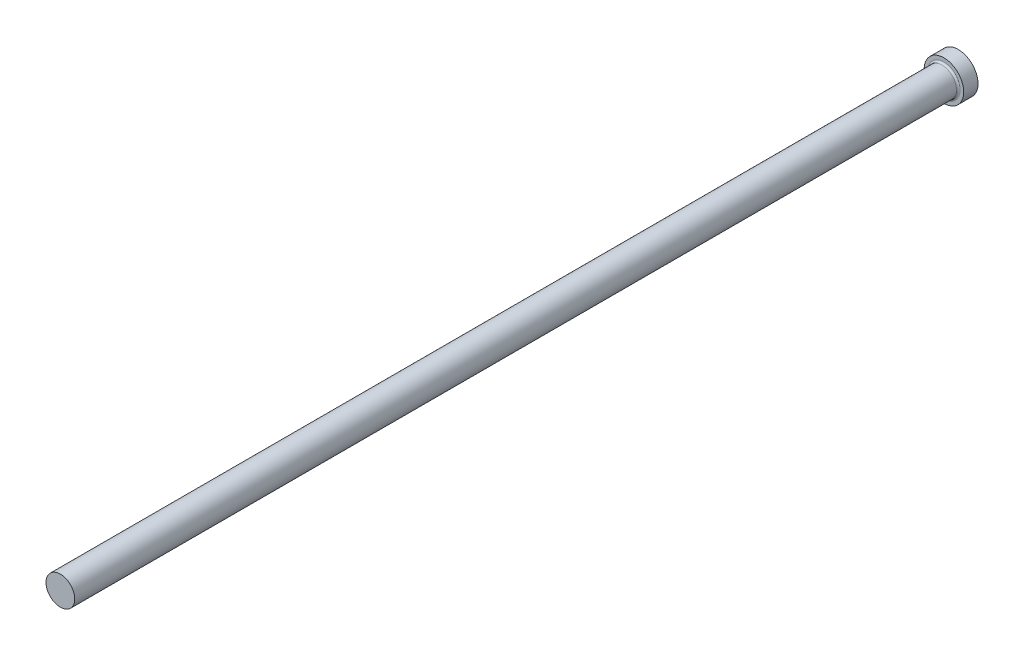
ISO-10303-21;
HEADER;
FILE_DESCRIPTION(('STEP AP214'),'2;1');
FILE_NAME('part.step','',(''),(''),'','','');
FILE_SCHEMA(('AUTOMOTIVE_DESIGN { 1 0 10303 214 1 1 1 1 }'));
ENDSEC;
DATA;
#1=APPLICATION_CONTEXT('core data for automotive mechanical design processes');
#2=APPLICATION_PROTOCOL_DEFINITION('international standard','automotive_design',2000,#1);
#3=PRODUCT_CONTEXT('',#1,'mechanical');
#4=PRODUCT('Part','Part','',(#3));
#5=PRODUCT_RELATED_PRODUCT_CATEGORY('part','',(#4));
#6=PRODUCT_DEFINITION_FORMATION('','',#4);
#7=PRODUCT_DEFINITION_CONTEXT('part definition',#1,'design');
#8=PRODUCT_DEFINITION('design','',#6,#7);
#9=PRODUCT_DEFINITION_SHAPE('','',#8);
#10=(LENGTH_UNIT() NAMED_UNIT(*) SI_UNIT(.MILLI.,.METRE.));
#11=(NAMED_UNIT(*) PLANE_ANGLE_UNIT() SI_UNIT($,.RADIAN.));
#12=(NAMED_UNIT(*) SI_UNIT($,.STERADIAN.) SOLID_ANGLE_UNIT());
#13=UNCERTAINTY_MEASURE_WITH_UNIT(LENGTH_MEASURE(1.E-05),#10,'distance_accuracy_value','');
#14=(GEOMETRIC_REPRESENTATION_CONTEXT(3) GLOBAL_UNCERTAINTY_ASSIGNED_CONTEXT((#13)) GLOBAL_UNIT_ASSIGNED_CONTEXT((#10,
#11,#12)) REPRESENTATION_CONTEXT('',''));
#15=CARTESIAN_POINT('',(0.,0.,0.));
#16=DIRECTION('',(0.,0.,1.));
#17=DIRECTION('',(1.,0.,0.));
#18=AXIS2_PLACEMENT_3D('',#15,#16,#17);
#19=CARTESIAN_POINT('',(5.5,0.,4.));
#20=DIRECTION('',(0.,0.,-1.));
#21=DIRECTION('',(-1.,0.,0.));
#22=AXIS2_PLACEMENT_3D('',#19,#20,#21);
#23=PLANE('',#22);
#24=CARTESIAN_POINT('',(0.,0.,4.));
#25=DIRECTION('',(0.,0.,-1.));
#26=DIRECTION('',(-1.,0.,0.));
#27=AXIS2_PLACEMENT_3D('',#24,#25,#26);
#28=CIRCLE('',#27,4.50000000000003);
#29=CARTESIAN_POINT('',(-4.50000000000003,0.,4.));
#30=VERTEX_POINT('',#29);
#31=EDGE_CURVE('E40',#30,#30,#28,.T.);
#32=ORIENTED_EDGE('',*,*,#31,.T.);
#33=EDGE_LOOP('',(#32));
#34=FACE_BOUND('',#33,.T.);
#35=CARTESIAN_POINT('',(0.,0.,4.));
#36=DIRECTION('',(0.,0.,-1.));
#37=DIRECTION('',(-1.,0.,0.));
#38=AXIS2_PLACEMENT_3D('',#35,#36,#37);
#39=CIRCLE('',#38,5.5);
#40=CARTESIAN_POINT('',(-5.5,0.,4.));
#41=VERTEX_POINT('',#40);
#42=EDGE_CURVE('E44',#41,#41,#39,.T.);
#43=ORIENTED_EDGE('',*,*,#42,.F.);
#44=EDGE_LOOP('',(#43));
#45=FACE_BOUND('',#44,.T.);
#46=ADVANCED_FACE('F33',(#34,#45),#23,.F.);
#47=CARTESIAN_POINT('',(0.,0.,-9.03322817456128));
#48=DIRECTION('',(0.,0.,-1.));
#49=DIRECTION('',(-1.,0.,0.));
#50=AXIS2_PLACEMENT_3D('',#47,#48,#49);
#51=CYLINDRICAL_SURFACE('',#50,5.5);
#52=CARTESIAN_POINT('',(0.,0.,0.));
#53=DIRECTION('',(0.,0.,-1.));
#54=DIRECTION('',(-1.,0.,0.));
#55=AXIS2_PLACEMENT_3D('',#52,#53,#54);
#56=CIRCLE('',#55,5.5);
#57=CARTESIAN_POINT('',(-5.5,0.,0.));
#58=VERTEX_POINT('',#57);
#59=EDGE_CURVE('E48',#58,#58,#56,.T.);
#60=ORIENTED_EDGE('',*,*,#59,.F.);
#61=EDGE_LOOP('',(#60));
#62=FACE_BOUND('',#61,.T.);
#63=ORIENTED_EDGE('',*,*,#42,.T.);
#64=EDGE_LOOP('',(#63));
#65=FACE_BOUND('',#64,.T.);
#66=ADVANCED_FACE('F68',(#62,#65),#51,.T.);
#67=CARTESIAN_POINT('',(0.,0.,0.));
#68=DIRECTION('',(0.,0.,1.));
#69=DIRECTION('',(1.,0.,0.));
#70=AXIS2_PLACEMENT_3D('',#67,#68,#69);
#71=PLANE('',#70);
#72=ORIENTED_EDGE('',*,*,#59,.T.);
#73=EDGE_LOOP('',(#72));
#74=FACE_BOUND('',#73,.T.);
#75=ADVANCED_FACE('F61',(#74),#71,.F.);
#76=CARTESIAN_POINT('',(0.,0.,250.));
#77=DIRECTION('',(0.,0.,-1.));
#78=DIRECTION('',(-1.,0.,0.));
#79=AXIS2_PLACEMENT_3D('',#76,#77,#78);
#80=PLANE('',#79);
#81=CARTESIAN_POINT('',(0.,0.,250.));
#82=DIRECTION('',(0.,0.,-1.));
#83=DIRECTION('',(-1.,0.,0.));
#84=AXIS2_PLACEMENT_3D('',#81,#82,#83);
#85=CIRCLE('',#84,4.00000000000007);
#86=CARTESIAN_POINT('',(-4.00000000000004,0.,250.));
#87=VERTEX_POINT('',#86);
#88=EDGE_CURVE('E53',#87,#87,#85,.T.);
#89=ORIENTED_EDGE('',*,*,#88,.F.);
#90=EDGE_LOOP('',(#89));
#91=FACE_BOUND('',#90,.T.);
#92=ADVANCED_FACE('F59',(#91),#80,.F.);
#93=CARTESIAN_POINT('',(0.,0.,-9.03322817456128));
#94=DIRECTION('',(0.,0.,-1.));
#95=DIRECTION('',(-1.,0.,0.));
#96=AXIS2_PLACEMENT_3D('',#93,#94,#95);
#97=CYLINDRICAL_SURFACE('',#96,4.00000000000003);
#98=CARTESIAN_POINT('',(0.,0.,4.5));
#99=DIRECTION('',(0.,0.,-1.));
#100=DIRECTION('',(-1.,0.,0.));
#101=AXIS2_PLACEMENT_3D('',#98,#99,#100);
#102=CIRCLE('',#101,4.00000000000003);
#103=CARTESIAN_POINT('',(-4.00000000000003,0.,4.5));
#104=VERTEX_POINT('',#103);
#105=EDGE_CURVE('E10',#104,#104,#102,.F.);
#106=ORIENTED_EDGE('',*,*,#105,.T.);
#107=EDGE_LOOP('',(#106));
#108=FACE_BOUND('',#107,.T.);
#109=ORIENTED_EDGE('',*,*,#88,.T.);
#110=EDGE_LOOP('',(#109));
#111=FACE_BOUND('',#110,.T.);
#112=ADVANCED_FACE('F57',(#108,#111),#97,.T.);
#113=CARTESIAN_POINT('',(0.,0.,4.5));
#114=DIRECTION('',(0.,0.,-1.));
#115=DIRECTION('',(-1.,0.,0.));
#116=AXIS2_PLACEMENT_3D('',#113,#114,#115);
#117=TOROIDAL_SURFACE('',#116,4.50000000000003,0.5);
#118=ORIENTED_EDGE('',*,*,#105,.F.);
#119=EDGE_LOOP('',(#118));
#120=FACE_BOUND('',#119,.T.);
#121=ORIENTED_EDGE('',*,*,#31,.F.);
#122=EDGE_LOOP('',(#121));
#123=FACE_BOUND('',#122,.T.);
#124=ADVANCED_FACE('F35',(#120,#123),#117,.F.);
#125=CLOSED_SHELL('',(#46,#66,#75,#92,#112,#124));
#126=MANIFOLD_SOLID_BREP('B2',#125);
#127=ADVANCED_BREP_SHAPE_REPRESENTATION('',(#18,#126),#14);
#128=SHAPE_DEFINITION_REPRESENTATION(#9,#127);
ENDSEC;
END-ISO-10303-21;
